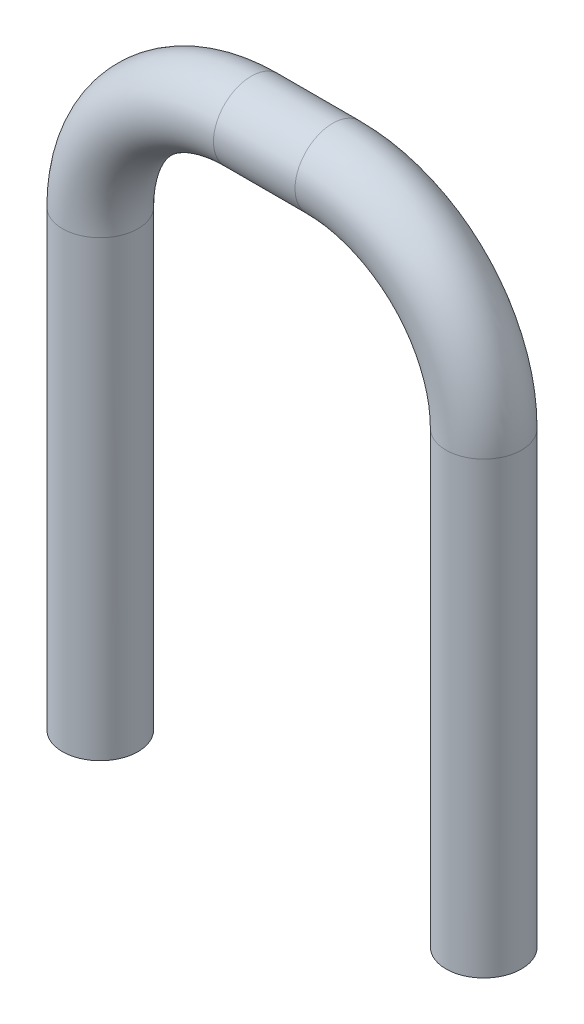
ISO-10303-21;
HEADER;
FILE_DESCRIPTION(('STEP AP214'),'2;1');
FILE_NAME('part.step','',(''),(''),'','','');
FILE_SCHEMA(('AUTOMOTIVE_DESIGN { 1 0 10303 214 1 1 1 1 }'));
ENDSEC;
DATA;
#1=APPLICATION_CONTEXT('core data for automotive mechanical design processes');
#2=APPLICATION_PROTOCOL_DEFINITION('international standard','automotive_design',2000,#1);
#3=PRODUCT_CONTEXT('',#1,'mechanical');
#4=PRODUCT('Part','Part','',(#3));
#5=PRODUCT_RELATED_PRODUCT_CATEGORY('part','',(#4));
#6=PRODUCT_DEFINITION_FORMATION('','',#4);
#7=PRODUCT_DEFINITION_CONTEXT('part definition',#1,'design');
#8=PRODUCT_DEFINITION('design','',#6,#7);
#9=PRODUCT_DEFINITION_SHAPE('','',#8);
#10=(LENGTH_UNIT() NAMED_UNIT(*) SI_UNIT(.MILLI.,.METRE.));
#11=(NAMED_UNIT(*) PLANE_ANGLE_UNIT() SI_UNIT($,.RADIAN.));
#12=(NAMED_UNIT(*) SI_UNIT($,.STERADIAN.) SOLID_ANGLE_UNIT());
#13=UNCERTAINTY_MEASURE_WITH_UNIT(LENGTH_MEASURE(1.E-05),#10,'distance_accuracy_value','');
#14=(GEOMETRIC_REPRESENTATION_CONTEXT(3) GLOBAL_UNCERTAINTY_ASSIGNED_CONTEXT((#13)) GLOBAL_UNIT_ASSIGNED_CONTEXT((#10,
#11,#12)) REPRESENTATION_CONTEXT('',''));
#15=CARTESIAN_POINT('',(0.,0.,0.));
#16=DIRECTION('',(0.,0.,1.));
#17=DIRECTION('',(1.,0.,0.));
#18=AXIS2_PLACEMENT_3D('',#15,#16,#17);
#19=CARTESIAN_POINT('',(2.54,2.99999999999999,0.));
#20=DIRECTION('',(0.,-1.,0.));
#21=DIRECTION('',(0.,0.,-1.));
#22=AXIS2_PLACEMENT_3D('',#19,#20,#21);
#23=CYLINDRICAL_SURFACE('',#22,0.25);
#24=CARTESIAN_POINT('',(2.54,2.99999999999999,0.));
#25=DIRECTION('',(0.,-1.,0.));
#26=DIRECTION('',(0.,0.,1.));
#27=AXIS2_PLACEMENT_3D('',#24,#25,#26);
#28=CIRCLE('',#27,0.25);
#29=CARTESIAN_POINT('',(2.79,2.99999999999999,0.));
#30=VERTEX_POINT('',#29);
#31=EDGE_CURVE('E41',#30,#30,#28,.T.);
#32=ORIENTED_EDGE('',*,*,#31,.T.);
#33=EDGE_LOOP('',(#32));
#34=FACE_BOUND('',#33,.T.);
#35=CARTESIAN_POINT('',(2.54,0.0236698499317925,0.));
#36=DIRECTION('',(0.,-1.,0.));
#37=DIRECTION('',(0.,0.,1.));
#38=AXIS2_PLACEMENT_3D('',#35,#36,#37);
#39=CIRCLE('',#38,0.25);
#40=CARTESIAN_POINT('',(2.54,0.0236698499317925,0.25));
#41=VERTEX_POINT('',#40);
#42=EDGE_CURVE('E10',#41,#41,#39,.T.);
#43=ORIENTED_EDGE('',*,*,#42,.F.);
#44=EDGE_LOOP('',(#43));
#45=FACE_BOUND('',#44,.T.);
#46=ADVANCED_FACE('F35',(#34,#45),#23,.T.);
#47=CARTESIAN_POINT('',(1.54,3.,0.));
#48=DIRECTION('',(0.,0.,-1.));
#49=DIRECTION('',(-1.,0.,0.));
#50=AXIS2_PLACEMENT_3D('',#47,#48,#49);
#51=TOROIDAL_SURFACE('',#50,1.,0.25);
#52=CARTESIAN_POINT('',(1.53999999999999,4.,0.));
#53=DIRECTION('',(1.,0.,0.));
#54=DIRECTION('',(0.,0.,1.));
#55=AXIS2_PLACEMENT_3D('',#52,#53,#54);
#56=CIRCLE('',#55,0.25);
#57=CARTESIAN_POINT('',(1.53999999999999,4.25,0.));
#58=VERTEX_POINT('',#57);
#59=EDGE_CURVE('E45',#58,#58,#56,.T.);
#60=CARTESIAN_POINT('',(1.54,3.,0.));
#61=DIRECTION('',(0.,0.,-1.));
#62=DIRECTION('',(-1.,0.,0.));
#63=AXIS2_PLACEMENT_3D('',#60,#61,#62);
#64=CIRCLE('',#63,1.25);
#65=EDGE_CURVE('',#58,#30,#64,.T.);
#66=ORIENTED_EDGE('',*,*,#59,.T.);
#67=ORIENTED_EDGE('',*,*,#31,.F.);
#68=ORIENTED_EDGE('',*,*,#65,.T.);
#69=ORIENTED_EDGE('',*,*,#65,.F.);
#70=EDGE_LOOP('',(#66,#68,#67,#69));
#71=FACE_BOUND('',#70,.T.);
#72=ADVANCED_FACE('F79',(#71),#51,.T.);
#73=CARTESIAN_POINT('',(1.00000000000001,4.,0.));
#74=DIRECTION('',(1.,0.,0.));
#75=DIRECTION('',(0.,0.,-1.));
#76=AXIS2_PLACEMENT_3D('',#73,#74,#75);
#77=CYLINDRICAL_SURFACE('',#76,0.25);
#78=CARTESIAN_POINT('',(1.00000000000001,4.,0.));
#79=DIRECTION('',(1.,0.,0.));
#80=DIRECTION('',(0.,0.,1.));
#81=AXIS2_PLACEMENT_3D('',#78,#79,#80);
#82=CIRCLE('',#81,0.25);
#83=CARTESIAN_POINT('',(1.00000000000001,4.25,0.));
#84=VERTEX_POINT('',#83);
#85=EDGE_CURVE('E49',#84,#84,#82,.T.);
#86=ORIENTED_EDGE('',*,*,#85,.T.);
#87=EDGE_LOOP('',(#86));
#88=FACE_BOUND('',#87,.T.);
#89=ORIENTED_EDGE('',*,*,#59,.F.);
#90=EDGE_LOOP('',(#89));
#91=FACE_BOUND('',#90,.T.);
#92=ADVANCED_FACE('F83',(#88,#91),#77,.T.);
#93=CARTESIAN_POINT('',(1.,3.,0.));
#94=DIRECTION('',(0.,0.,-1.));
#95=DIRECTION('',(-1.,0.,0.));
#96=AXIS2_PLACEMENT_3D('',#93,#94,#95);
#97=TOROIDAL_SURFACE('',#96,1.,0.25);
#98=CARTESIAN_POINT('',(0.,2.99999999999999,0.));
#99=DIRECTION('',(0.,1.,0.));
#100=DIRECTION('',(0.,0.,1.));
#101=AXIS2_PLACEMENT_3D('',#98,#99,#100);
#102=CIRCLE('',#101,0.25);
#103=CARTESIAN_POINT('',(-0.25,2.99999999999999,0.));
#104=VERTEX_POINT('',#103);
#105=EDGE_CURVE('E54',#104,#104,#102,.T.);
#106=CARTESIAN_POINT('',(1.,3.,0.));
#107=DIRECTION('',(0.,0.,-1.));
#108=DIRECTION('',(-1.,0.,0.));
#109=AXIS2_PLACEMENT_3D('',#106,#107,#108);
#110=CIRCLE('',#109,1.25);
#111=EDGE_CURVE('',#104,#84,#110,.T.);
#112=ORIENTED_EDGE('',*,*,#105,.T.);
#113=ORIENTED_EDGE('',*,*,#85,.F.);
#114=ORIENTED_EDGE('',*,*,#111,.T.);
#115=ORIENTED_EDGE('',*,*,#111,.F.);
#116=EDGE_LOOP('',(#112,#114,#113,#115));
#117=FACE_BOUND('',#116,.T.);
#118=ADVANCED_FACE('F61',(#117),#97,.T.);
#119=CARTESIAN_POINT('',(0.,2.99999999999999,0.));
#120=DIRECTION('',(0.,-1.,0.));
#121=DIRECTION('',(0.,0.,-1.));
#122=AXIS2_PLACEMENT_3D('',#119,#120,#121);
#123=CYLINDRICAL_SURFACE('',#122,0.25);
#124=ORIENTED_EDGE('',*,*,#105,.F.);
#125=EDGE_LOOP('',(#124));
#126=FACE_BOUND('',#125,.T.);
#127=CARTESIAN_POINT('',(0.,0.,0.));
#128=DIRECTION('',(0.,1.,0.));
#129=DIRECTION('',(0.,0.,1.));
#130=AXIS2_PLACEMENT_3D('',#127,#128,#129);
#131=CIRCLE('',#130,0.25);
#132=CARTESIAN_POINT('',(0.,0.,0.25));
#133=VERTEX_POINT('',#132);
#134=EDGE_CURVE('E55',#133,#133,#131,.T.);
#135=ORIENTED_EDGE('',*,*,#134,.T.);
#136=EDGE_LOOP('',(#135));
#137=FACE_BOUND('',#136,.T.);
#138=ADVANCED_FACE('F64',(#126,#137),#123,.T.);
#139=CARTESIAN_POINT('',(2.54,0.0236698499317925,0.));
#140=DIRECTION('',(0.,-1.,0.));
#141=DIRECTION('',(0.,0.,1.));
#142=AXIS2_PLACEMENT_3D('',#139,#140,#141);
#143=PLANE('',#142);
#144=ORIENTED_EDGE('',*,*,#42,.T.);
#145=EDGE_LOOP('',(#144));
#146=FACE_BOUND('',#145,.T.);
#147=ADVANCED_FACE('F67',(#146),#143,.T.);
#148=CARTESIAN_POINT('',(0.,0.,0.));
#149=DIRECTION('',(0.,1.,0.));
#150=DIRECTION('',(0.,0.,1.));
#151=AXIS2_PLACEMENT_3D('',#148,#149,#150);
#152=PLANE('',#151);
#153=ORIENTED_EDGE('',*,*,#134,.F.);
#154=EDGE_LOOP('',(#153));
#155=FACE_BOUND('',#154,.T.);
#156=ADVANCED_FACE('F71',(#155),#152,.F.);
#157=CLOSED_SHELL('',(#46,#72,#92,#118,#138,#147,#156));
#158=MANIFOLD_SOLID_BREP('B2',#157);
#159=ADVANCED_BREP_SHAPE_REPRESENTATION('',(#18,#158),#14);
#160=SHAPE_DEFINITION_REPRESENTATION(#9,#159);
ENDSEC;
END-ISO-10303-21;
